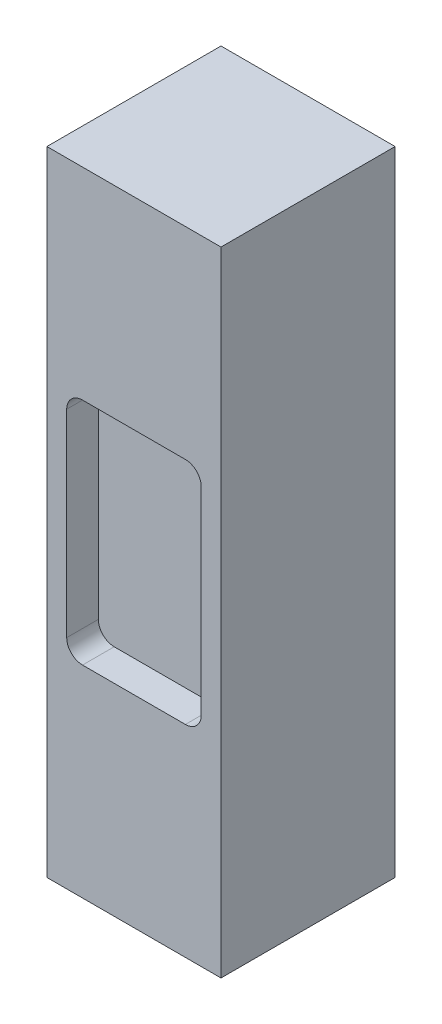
ISO-10303-21;
HEADER;
FILE_DESCRIPTION(('STEP AP214'),'2;1');
FILE_NAME('part.step','',(''),(''),'','','');
FILE_SCHEMA(('AUTOMOTIVE_DESIGN { 1 0 10303 214 1 1 1 1 }'));
ENDSEC;
DATA;
#1=APPLICATION_CONTEXT('core data for automotive mechanical design processes');
#2=APPLICATION_PROTOCOL_DEFINITION('international standard','automotive_design',2000,#1);
#3=PRODUCT_CONTEXT('',#1,'mechanical');
#4=PRODUCT('Part','Part','',(#3));
#5=PRODUCT_RELATED_PRODUCT_CATEGORY('part','',(#4));
#6=PRODUCT_DEFINITION_FORMATION('','',#4);
#7=PRODUCT_DEFINITION_CONTEXT('part definition',#1,'design');
#8=PRODUCT_DEFINITION('design','',#6,#7);
#9=PRODUCT_DEFINITION_SHAPE('','',#8);
#10=(LENGTH_UNIT() NAMED_UNIT(*) SI_UNIT(.MILLI.,.METRE.));
#11=(NAMED_UNIT(*) PLANE_ANGLE_UNIT() SI_UNIT($,.RADIAN.));
#12=(NAMED_UNIT(*) SI_UNIT($,.STERADIAN.) SOLID_ANGLE_UNIT());
#13=UNCERTAINTY_MEASURE_WITH_UNIT(LENGTH_MEASURE(1.E-05),#10,'distance_accuracy_value','');
#14=(GEOMETRIC_REPRESENTATION_CONTEXT(3) GLOBAL_UNCERTAINTY_ASSIGNED_CONTEXT((#13)) GLOBAL_UNIT_ASSIGNED_CONTEXT((#10,
#11,#12)) REPRESENTATION_CONTEXT('',''));
#15=CARTESIAN_POINT('',(0.,0.,0.));
#16=DIRECTION('',(0.,0.,1.));
#17=DIRECTION('',(1.,0.,0.));
#18=AXIS2_PLACEMENT_3D('',#15,#16,#17);
#19=CARTESIAN_POINT('',(69.85,508.,-69.85));
#20=DIRECTION('',(-1.,0.,0.));
#21=DIRECTION('',(0.,0.,1.));
#22=AXIS2_PLACEMENT_3D('',#19,#20,#21);
#23=PLANE('',#22);
#24=DIRECTION('',(0.,0.,-1.));
#25=VECTOR('',#24,1.);
#26=CARTESIAN_POINT('',(69.85,0.,-69.85));
#27=LINE('',#26,#25);
#28=CARTESIAN_POINT('',(69.85,0.,69.85));
#29=VERTEX_POINT('',#28);
#30=CARTESIAN_POINT('',(69.85,0.,-69.85));
#31=VERTEX_POINT('',#30);
#32=EDGE_CURVE('E162',#29,#31,#27,.T.);
#33=ORIENTED_EDGE('',*,*,#32,.T.);
#34=DIRECTION('',(0.,-1.,0.));
#35=VECTOR('',#34,1.);
#36=CARTESIAN_POINT('',(69.85,508.,-69.85));
#37=LINE('',#36,#35);
#38=CARTESIAN_POINT('',(69.85,508.,-69.85));
#39=VERTEX_POINT('',#38);
#40=EDGE_CURVE('E141',#39,#31,#37,.T.);
#41=ORIENTED_EDGE('',*,*,#40,.F.);
#42=DIRECTION('',(0.,0.,-1.));
#43=VECTOR('',#42,1.);
#44=CARTESIAN_POINT('',(69.85,508.,-69.85));
#45=LINE('',#44,#43);
#46=CARTESIAN_POINT('',(69.85,508.,69.85));
#47=VERTEX_POINT('',#46);
#48=EDGE_CURVE('E149',#47,#39,#45,.T.);
#49=ORIENTED_EDGE('',*,*,#48,.F.);
#50=DIRECTION('',(0.,-1.,0.));
#51=VECTOR('',#50,1.);
#52=CARTESIAN_POINT('',(69.85,508.,69.85));
#53=LINE('',#52,#51);
#54=EDGE_CURVE('E257',#47,#29,#53,.T.);
#55=ORIENTED_EDGE('',*,*,#54,.T.);
#56=EDGE_LOOP('',(#33,#41,#49,#55));
#57=FACE_BOUND('',#56,.T.);
#58=ADVANCED_FACE('F38',(#57),#23,.F.);
#59=CARTESIAN_POINT('',(-69.85,508.,-69.85));
#60=DIRECTION('',(0.,0.,1.));
#61=DIRECTION('',(1.,0.,0.));
#62=AXIS2_PLACEMENT_3D('',#59,#60,#61);
#63=PLANE('',#62);
#64=DIRECTION('',(-1.,0.,0.));
#65=VECTOR('',#64,1.);
#66=CARTESIAN_POINT('',(-69.85,0.,-69.85));
#67=LINE('',#66,#65);
#68=CARTESIAN_POINT('',(-69.85,0.,-69.85));
#69=VERTEX_POINT('',#68);
#70=EDGE_CURVE('E259',#31,#69,#67,.T.);
#71=ORIENTED_EDGE('',*,*,#70,.T.);
#72=DIRECTION('',(0.,-1.,0.));
#73=VECTOR('',#72,1.);
#74=CARTESIAN_POINT('',(-69.85,508.,-69.85));
#75=LINE('',#74,#73);
#76=CARTESIAN_POINT('',(-69.85,508.,-69.85));
#77=VERTEX_POINT('',#76);
#78=EDGE_CURVE('E144',#77,#69,#75,.T.);
#79=ORIENTED_EDGE('',*,*,#78,.F.);
#80=DIRECTION('',(-1.,0.,0.));
#81=VECTOR('',#80,1.);
#82=CARTESIAN_POINT('',(-69.85,508.,-69.85));
#83=LINE('',#82,#81);
#84=EDGE_CURVE('E137',#39,#77,#83,.T.);
#85=ORIENTED_EDGE('',*,*,#84,.F.);
#86=ORIENTED_EDGE('',*,*,#40,.T.);
#87=EDGE_LOOP('',(#71,#79,#85,#86));
#88=FACE_BOUND('',#87,.T.);
#89=ADVANCED_FACE('F139',(#88),#63,.F.);
#90=CARTESIAN_POINT('',(-69.85,508.,-69.85));
#91=DIRECTION('',(1.,0.,0.));
#92=DIRECTION('',(0.,0.,-1.));
#93=AXIS2_PLACEMENT_3D('',#90,#91,#92);
#94=PLANE('',#93);
#95=DIRECTION('',(0.,0.,1.));
#96=VECTOR('',#95,1.);
#97=CARTESIAN_POINT('',(-69.85,0.,-69.85));
#98=LINE('',#97,#96);
#99=CARTESIAN_POINT('',(-69.85,0.,69.85));
#100=VERTEX_POINT('',#99);
#101=EDGE_CURVE('E261',#69,#100,#98,.T.);
#102=ORIENTED_EDGE('',*,*,#101,.T.);
#103=DIRECTION('',(0.,-1.,0.));
#104=VECTOR('',#103,1.);
#105=CARTESIAN_POINT('',(-69.85,508.,69.85));
#106=LINE('',#105,#104);
#107=CARTESIAN_POINT('',(-69.85,508.,69.85));
#108=VERTEX_POINT('',#107);
#109=EDGE_CURVE('E171',#108,#100,#106,.T.);
#110=ORIENTED_EDGE('',*,*,#109,.F.);
#111=DIRECTION('',(0.,0.,1.));
#112=VECTOR('',#111,1.);
#113=CARTESIAN_POINT('',(-69.85,508.,-69.85));
#114=LINE('',#113,#112);
#115=EDGE_CURVE('E148',#77,#108,#114,.T.);
#116=ORIENTED_EDGE('',*,*,#115,.F.);
#117=ORIENTED_EDGE('',*,*,#78,.T.);
#118=EDGE_LOOP('',(#102,#110,#116,#117));
#119=FACE_BOUND('',#118,.T.);
#120=ADVANCED_FACE('F273',(#119),#94,.F.);
#121=CARTESIAN_POINT('',(-69.85,508.,69.85));
#122=DIRECTION('',(0.,0.,-1.));
#123=DIRECTION('',(-1.,0.,0.));
#124=AXIS2_PLACEMENT_3D('',#121,#122,#123);
#125=PLANE('',#124);
#126=DIRECTION('',(1.,0.,0.));
#127=VECTOR('',#126,1.);
#128=CARTESIAN_POINT('',(53.975,161.925,69.85));
#129=LINE('',#128,#127);
#130=CARTESIAN_POINT('',(-41.2749999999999,161.925,69.85));
#131=VERTEX_POINT('',#130);
#132=CARTESIAN_POINT('',(41.275,161.925,69.85));
#133=VERTEX_POINT('',#132);
#134=EDGE_CURVE('E248',#131,#133,#129,.T.);
#135=ORIENTED_EDGE('',*,*,#134,.F.);
#136=CARTESIAN_POINT('',(-41.2749999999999,174.625,69.85));
#137=DIRECTION('',(0.,0.,-1.));
#138=DIRECTION('',(-1.,0.,0.));
#139=AXIS2_PLACEMENT_3D('',#136,#137,#138);
#140=CIRCLE('',#139,12.7);
#141=CARTESIAN_POINT('',(-53.9749999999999,174.625,69.85));
#142=VERTEX_POINT('',#141);
#143=EDGE_CURVE('E11',#131,#142,#140,.T.);
#144=ORIENTED_EDGE('',*,*,#143,.T.);
#145=DIRECTION('',(0.,-1.,0.));
#146=VECTOR('',#145,1.);
#147=CARTESIAN_POINT('',(-53.9749999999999,161.925,69.85));
#148=LINE('',#147,#146);
#149=CARTESIAN_POINT('',(-53.975,333.375,69.85));
#150=VERTEX_POINT('',#149);
#151=EDGE_CURVE('E215',#150,#142,#148,.T.);
#152=ORIENTED_EDGE('',*,*,#151,.F.);
#153=CARTESIAN_POINT('',(-41.275,333.375,69.85));
#154=DIRECTION('',(0.,0.,-1.));
#155=DIRECTION('',(-1.,0.,0.));
#156=AXIS2_PLACEMENT_3D('',#153,#154,#155);
#157=CIRCLE('',#156,12.7);
#158=CARTESIAN_POINT('',(-41.275,346.075,69.85));
#159=VERTEX_POINT('',#158);
#160=EDGE_CURVE('E46',#150,#159,#157,.T.);
#161=ORIENTED_EDGE('',*,*,#160,.T.);
#162=DIRECTION('',(-1.,0.,0.));
#163=VECTOR('',#162,1.);
#164=CARTESIAN_POINT('',(53.975,346.075,69.85));
#165=LINE('',#164,#163);
#166=CARTESIAN_POINT('',(41.275,346.075,69.85));
#167=VERTEX_POINT('',#166);
#168=EDGE_CURVE('E214',#167,#159,#165,.T.);
#169=ORIENTED_EDGE('',*,*,#168,.F.);
#170=CARTESIAN_POINT('',(41.275,333.375,69.85));
#171=DIRECTION('',(0.,0.,-1.));
#172=DIRECTION('',(-1.,0.,0.));
#173=AXIS2_PLACEMENT_3D('',#170,#171,#172);
#174=CIRCLE('',#173,12.7);
#175=CARTESIAN_POINT('',(53.975,333.375,69.85));
#176=VERTEX_POINT('',#175);
#177=EDGE_CURVE('E206',#167,#176,#174,.T.);
#178=ORIENTED_EDGE('',*,*,#177,.T.);
#179=DIRECTION('',(0.,1.,0.));
#180=VECTOR('',#179,1.);
#181=CARTESIAN_POINT('',(53.975,161.925,69.85));
#182=LINE('',#181,#180);
#183=CARTESIAN_POINT('',(53.975,174.625,69.85));
#184=VERTEX_POINT('',#183);
#185=EDGE_CURVE('E223',#184,#176,#182,.T.);
#186=ORIENTED_EDGE('',*,*,#185,.F.);
#187=CARTESIAN_POINT('',(41.275,174.625,69.85));
#188=DIRECTION('',(0.,0.,-1.));
#189=DIRECTION('',(-1.,0.,0.));
#190=AXIS2_PLACEMENT_3D('',#187,#188,#189);
#191=CIRCLE('',#190,12.7);
#192=EDGE_CURVE('E204',#184,#133,#191,.T.);
#193=ORIENTED_EDGE('',*,*,#192,.T.);
#194=EDGE_LOOP('',(#135,#144,#152,#161,#169,#178,#186,#193));
#195=FACE_BOUND('',#194,.T.);
#196=DIRECTION('',(1.,0.,0.));
#197=VECTOR('',#196,1.);
#198=CARTESIAN_POINT('',(-69.85,0.,69.85));
#199=LINE('',#198,#197);
#200=EDGE_CURVE('E159',#100,#29,#199,.T.);
#201=ORIENTED_EDGE('',*,*,#200,.T.);
#202=ORIENTED_EDGE('',*,*,#54,.F.);
#203=DIRECTION('',(1.,0.,0.));
#204=VECTOR('',#203,1.);
#205=CARTESIAN_POINT('',(-69.85,508.,69.85));
#206=LINE('',#205,#204);
#207=EDGE_CURVE('E154',#108,#47,#206,.T.);
#208=ORIENTED_EDGE('',*,*,#207,.F.);
#209=ORIENTED_EDGE('',*,*,#109,.T.);
#210=EDGE_LOOP('',(#201,#202,#208,#209));
#211=FACE_BOUND('',#210,.T.);
#212=ADVANCED_FACE('F212',(#195,#211),#125,.F.);
#213=CARTESIAN_POINT('',(69.85,508.,69.85));
#214=DIRECTION('',(0.,1.,0.));
#215=DIRECTION('',(0.,0.,1.));
#216=AXIS2_PLACEMENT_3D('',#213,#214,#215);
#217=PLANE('',#216);
#218=ORIENTED_EDGE('',*,*,#48,.T.);
#219=ORIENTED_EDGE('',*,*,#84,.T.);
#220=ORIENTED_EDGE('',*,*,#115,.T.);
#221=ORIENTED_EDGE('',*,*,#207,.T.);
#222=EDGE_LOOP('',(#218,#219,#220,#221));
#223=FACE_BOUND('',#222,.T.);
#224=ADVANCED_FACE('F152',(#223),#217,.T.);
#225=CARTESIAN_POINT('',(69.85,0.,69.85));
#226=DIRECTION('',(0.,1.,0.));
#227=DIRECTION('',(0.,0.,1.));
#228=AXIS2_PLACEMENT_3D('',#225,#226,#227);
#229=PLANE('',#228);
#230=ORIENTED_EDGE('',*,*,#32,.F.);
#231=ORIENTED_EDGE('',*,*,#200,.F.);
#232=ORIENTED_EDGE('',*,*,#101,.F.);
#233=ORIENTED_EDGE('',*,*,#70,.F.);
#234=EDGE_LOOP('',(#230,#231,#232,#233));
#235=FACE_BOUND('',#234,.T.);
#236=ADVANCED_FACE('F272',(#235),#229,.F.);
#237=CARTESIAN_POINT('',(-53.9749999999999,161.925,44.45));
#238=DIRECTION('',(-1.,0.,0.));
#239=DIRECTION('',(0.,-1.,0.));
#240=AXIS2_PLACEMENT_3D('',#237,#238,#239);
#241=PLANE('',#240);
#242=DIRECTION('',(0.,-1.,0.));
#243=VECTOR('',#242,1.);
#244=CARTESIAN_POINT('',(-53.9749999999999,161.925,44.45));
#245=LINE('',#244,#243);
#246=CARTESIAN_POINT('',(-53.975,333.375,44.45));
#247=VERTEX_POINT('',#246);
#248=CARTESIAN_POINT('',(-53.9749999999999,174.625,44.45));
#249=VERTEX_POINT('',#248);
#250=EDGE_CURVE('E222',#247,#249,#245,.T.);
#251=ORIENTED_EDGE('',*,*,#250,.F.);
#252=DIRECTION('',(0.,0.,1.));
#253=VECTOR('',#252,1.);
#254=CARTESIAN_POINT('',(-53.975,333.375,69.85));
#255=LINE('',#254,#253);
#256=EDGE_CURVE('E201',#247,#150,#255,.T.);
#257=ORIENTED_EDGE('',*,*,#256,.T.);
#258=ORIENTED_EDGE('',*,*,#151,.T.);
#259=DIRECTION('',(0.,0.,1.));
#260=VECTOR('',#259,1.);
#261=CARTESIAN_POINT('',(-53.9749999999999,174.625,44.45));
#262=LINE('',#261,#260);
#263=EDGE_CURVE('E199',#142,#249,#262,.F.);
#264=ORIENTED_EDGE('',*,*,#263,.T.);
#265=EDGE_LOOP('',(#251,#257,#258,#264));
#266=FACE_BOUND('',#265,.T.);
#267=ADVANCED_FACE('F235',(#266),#241,.F.);
#268=CARTESIAN_POINT('',(53.975,346.075,44.45));
#269=DIRECTION('',(0.,1.,0.));
#270=DIRECTION('',(0.,0.,1.));
#271=AXIS2_PLACEMENT_3D('',#268,#269,#270);
#272=PLANE('',#271);
#273=DIRECTION('',(-1.,0.,0.));
#274=VECTOR('',#273,1.);
#275=CARTESIAN_POINT('',(53.975,346.075,44.45));
#276=LINE('',#275,#274);
#277=CARTESIAN_POINT('',(41.275,346.075,44.45));
#278=VERTEX_POINT('',#277);
#279=CARTESIAN_POINT('',(-41.275,346.075,44.45));
#280=VERTEX_POINT('',#279);
#281=EDGE_CURVE('E233',#278,#280,#276,.T.);
#282=ORIENTED_EDGE('',*,*,#281,.F.);
#283=DIRECTION('',(0.,0.,1.));
#284=VECTOR('',#283,1.);
#285=CARTESIAN_POINT('',(41.275,346.075,69.85));
#286=LINE('',#285,#284);
#287=EDGE_CURVE('E195',#278,#167,#286,.T.);
#288=ORIENTED_EDGE('',*,*,#287,.T.);
#289=ORIENTED_EDGE('',*,*,#168,.T.);
#290=DIRECTION('',(0.,0.,1.));
#291=VECTOR('',#290,1.);
#292=CARTESIAN_POINT('',(-41.275,346.075,44.45));
#293=LINE('',#292,#291);
#294=EDGE_CURVE('E192',#159,#280,#293,.F.);
#295=ORIENTED_EDGE('',*,*,#294,.T.);
#296=EDGE_LOOP('',(#282,#288,#289,#295));
#297=FACE_BOUND('',#296,.T.);
#298=ADVANCED_FACE('F218',(#297),#272,.F.);
#299=CARTESIAN_POINT('',(53.975,161.925,44.45));
#300=DIRECTION('',(1.,0.,0.));
#301=DIRECTION('',(0.,0.,-1.));
#302=AXIS2_PLACEMENT_3D('',#299,#300,#301);
#303=PLANE('',#302);
#304=DIRECTION('',(0.,1.,0.));
#305=VECTOR('',#304,1.);
#306=CARTESIAN_POINT('',(53.975,161.925,44.45));
#307=LINE('',#306,#305);
#308=CARTESIAN_POINT('',(53.975,174.625,44.45));
#309=VERTEX_POINT('',#308);
#310=CARTESIAN_POINT('',(53.975,333.375,44.45));
#311=VERTEX_POINT('',#310);
#312=EDGE_CURVE('E239',#309,#311,#307,.T.);
#313=ORIENTED_EDGE('',*,*,#312,.F.);
#314=DIRECTION('',(0.,0.,1.));
#315=VECTOR('',#314,1.);
#316=CARTESIAN_POINT('',(53.975,174.625,69.85));
#317=LINE('',#316,#315);
#318=EDGE_CURVE('E168',#309,#184,#317,.T.);
#319=ORIENTED_EDGE('',*,*,#318,.T.);
#320=ORIENTED_EDGE('',*,*,#185,.T.);
#321=DIRECTION('',(0.,0.,1.));
#322=VECTOR('',#321,1.);
#323=CARTESIAN_POINT('',(53.975,333.375,44.45));
#324=LINE('',#323,#322);
#325=EDGE_CURVE('E164',#176,#311,#324,.F.);
#326=ORIENTED_EDGE('',*,*,#325,.T.);
#327=EDGE_LOOP('',(#313,#319,#320,#326));
#328=FACE_BOUND('',#327,.T.);
#329=ADVANCED_FACE('F311',(#328),#303,.F.);
#330=CARTESIAN_POINT('',(53.975,161.925,44.45));
#331=DIRECTION('',(0.,-1.,0.));
#332=DIRECTION('',(0.,0.,-1.));
#333=AXIS2_PLACEMENT_3D('',#330,#331,#332);
#334=PLANE('',#333);
#335=ORIENTED_EDGE('',*,*,#134,.T.);
#336=DIRECTION('',(0.,0.,1.));
#337=VECTOR('',#336,1.);
#338=CARTESIAN_POINT('',(41.275,161.925,44.45));
#339=LINE('',#338,#337);
#340=CARTESIAN_POINT('',(41.275,161.925,44.45));
#341=VERTEX_POINT('',#340);
#342=EDGE_CURVE('E180',#133,#341,#339,.F.);
#343=ORIENTED_EDGE('',*,*,#342,.T.);
#344=DIRECTION('',(1.,0.,0.));
#345=VECTOR('',#344,1.);
#346=CARTESIAN_POINT('',(53.975,161.925,44.45));
#347=LINE('',#346,#345);
#348=CARTESIAN_POINT('',(-41.2749999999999,161.925,44.45));
#349=VERTEX_POINT('',#348);
#350=EDGE_CURVE('E237',#349,#341,#347,.T.);
#351=ORIENTED_EDGE('',*,*,#350,.F.);
#352=DIRECTION('',(0.,0.,1.));
#353=VECTOR('',#352,1.);
#354=CARTESIAN_POINT('',(-41.2749999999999,161.925,69.85));
#355=LINE('',#354,#353);
#356=EDGE_CURVE('E177',#349,#131,#355,.T.);
#357=ORIENTED_EDGE('',*,*,#356,.T.);
#358=EDGE_LOOP('',(#335,#343,#351,#357));
#359=FACE_BOUND('',#358,.T.);
#360=ADVANCED_FACE('F305',(#359),#334,.F.);
#361=CARTESIAN_POINT('',(-53.975,346.075,44.45));
#362=DIRECTION('',(0.,0.,1.));
#363=DIRECTION('',(1.,0.,0.));
#364=AXIS2_PLACEMENT_3D('',#361,#362,#363);
#365=PLANE('',#364);
#366=ORIENTED_EDGE('',*,*,#350,.T.);
#367=CARTESIAN_POINT('',(41.275,174.625,44.45));
#368=DIRECTION('',(0.,0.,1.));
#369=DIRECTION('',(1.,0.,0.));
#370=AXIS2_PLACEMENT_3D('',#367,#368,#369);
#371=CIRCLE('',#370,12.7);
#372=EDGE_CURVE('E190',#341,#309,#371,.T.);
#373=ORIENTED_EDGE('',*,*,#372,.T.);
#374=ORIENTED_EDGE('',*,*,#312,.T.);
#375=CARTESIAN_POINT('',(41.275,333.375,44.45));
#376=DIRECTION('',(0.,0.,1.));
#377=DIRECTION('',(1.,0.,0.));
#378=AXIS2_PLACEMENT_3D('',#375,#376,#377);
#379=CIRCLE('',#378,12.7);
#380=EDGE_CURVE('E187',#311,#278,#379,.T.);
#381=ORIENTED_EDGE('',*,*,#380,.T.);
#382=ORIENTED_EDGE('',*,*,#281,.T.);
#383=CARTESIAN_POINT('',(-41.275,333.375,44.45));
#384=DIRECTION('',(0.,0.,1.));
#385=DIRECTION('',(1.,0.,0.));
#386=AXIS2_PLACEMENT_3D('',#383,#384,#385);
#387=CIRCLE('',#386,12.7);
#388=EDGE_CURVE('E184',#280,#247,#387,.T.);
#389=ORIENTED_EDGE('',*,*,#388,.T.);
#390=ORIENTED_EDGE('',*,*,#250,.T.);
#391=CARTESIAN_POINT('',(-41.2749999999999,174.625,44.45));
#392=DIRECTION('',(0.,0.,1.));
#393=DIRECTION('',(1.,0.,0.));
#394=AXIS2_PLACEMENT_3D('',#391,#392,#393);
#395=CIRCLE('',#394,12.7);
#396=EDGE_CURVE('E182',#249,#349,#395,.T.);
#397=ORIENTED_EDGE('',*,*,#396,.T.);
#398=EDGE_LOOP('',(#366,#373,#374,#381,#382,#389,#390,#397));
#399=FACE_BOUND('',#398,.T.);
#400=ADVANCED_FACE('F231',(#399),#365,.T.);
#401=CARTESIAN_POINT('',(41.275,174.625,44.45));
#402=DIRECTION('',(0.,0.,-1.));
#403=DIRECTION('',(-1.,0.,0.));
#404=AXIS2_PLACEMENT_3D('',#401,#402,#403);
#405=CYLINDRICAL_SURFACE('',#404,12.7);
#406=ORIENTED_EDGE('',*,*,#372,.F.);
#407=ORIENTED_EDGE('',*,*,#342,.F.);
#408=ORIENTED_EDGE('',*,*,#192,.F.);
#409=ORIENTED_EDGE('',*,*,#318,.F.);
#410=EDGE_LOOP('',(#406,#407,#408,#409));
#411=FACE_BOUND('',#410,.T.);
#412=ADVANCED_FACE('F287',(#411),#405,.F.);
#413=CARTESIAN_POINT('',(41.275,333.375,44.45));
#414=DIRECTION('',(0.,0.,-1.));
#415=DIRECTION('',(-1.,0.,0.));
#416=AXIS2_PLACEMENT_3D('',#413,#414,#415);
#417=CYLINDRICAL_SURFACE('',#416,12.7);
#418=ORIENTED_EDGE('',*,*,#380,.F.);
#419=ORIENTED_EDGE('',*,*,#325,.F.);
#420=ORIENTED_EDGE('',*,*,#177,.F.);
#421=ORIENTED_EDGE('',*,*,#287,.F.);
#422=EDGE_LOOP('',(#418,#419,#420,#421));
#423=FACE_BOUND('',#422,.T.);
#424=ADVANCED_FACE('F290',(#423),#417,.F.);
#425=CARTESIAN_POINT('',(-41.275,333.375,44.45));
#426=DIRECTION('',(0.,0.,-1.));
#427=DIRECTION('',(-1.,0.,0.));
#428=AXIS2_PLACEMENT_3D('',#425,#426,#427);
#429=CYLINDRICAL_SURFACE('',#428,12.7);
#430=ORIENTED_EDGE('',*,*,#388,.F.);
#431=ORIENTED_EDGE('',*,*,#294,.F.);
#432=ORIENTED_EDGE('',*,*,#160,.F.);
#433=ORIENTED_EDGE('',*,*,#256,.F.);
#434=EDGE_LOOP('',(#430,#431,#432,#433));
#435=FACE_BOUND('',#434,.T.);
#436=ADVANCED_FACE('F226',(#435),#429,.F.);
#437=CARTESIAN_POINT('',(-41.2749999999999,174.625,44.45));
#438=DIRECTION('',(0.,0.,-1.));
#439=DIRECTION('',(-1.,0.,0.));
#440=AXIS2_PLACEMENT_3D('',#437,#438,#439);
#441=CYLINDRICAL_SURFACE('',#440,12.7);
#442=ORIENTED_EDGE('',*,*,#396,.F.);
#443=ORIENTED_EDGE('',*,*,#263,.F.);
#444=ORIENTED_EDGE('',*,*,#143,.F.);
#445=ORIENTED_EDGE('',*,*,#356,.F.);
#446=EDGE_LOOP('',(#442,#443,#444,#445));
#447=FACE_BOUND('',#446,.T.);
#448=ADVANCED_FACE('F40',(#447),#441,.F.);
#449=CLOSED_SHELL('',(#58,#89,#120,#212,#224,#236,#267,#298,#329,#360,#400,#412,#424,#436,#448));
#450=MANIFOLD_SOLID_BREP('B2',#449);
#451=ADVANCED_BREP_SHAPE_REPRESENTATION('',(#18,#450),#14);
#452=SHAPE_DEFINITION_REPRESENTATION(#9,#451);
ENDSEC;
END-ISO-10303-21;
